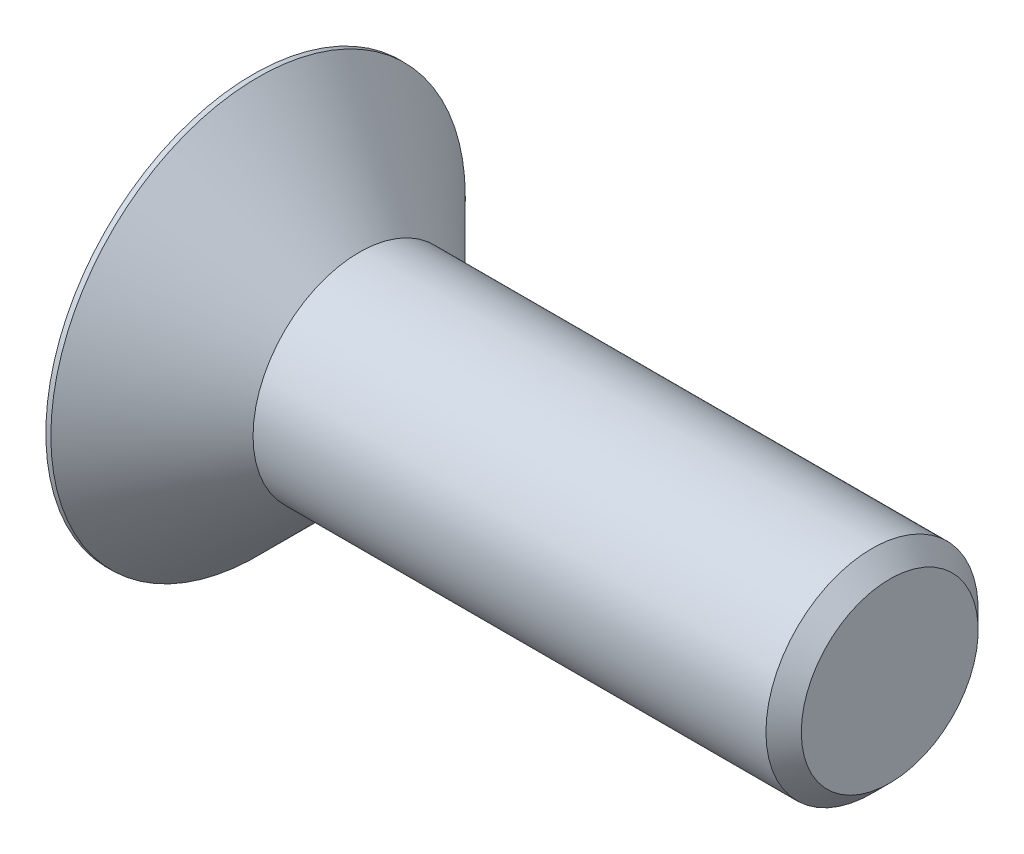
ISO-10303-21;
HEADER;
FILE_DESCRIPTION(('STEP AP214'),'2;1');
FILE_NAME('part.step','',(''),(''),'','','');
FILE_SCHEMA(('AUTOMOTIVE_DESIGN { 1 0 10303 214 1 1 1 1 }'));
ENDSEC;
DATA;
#1=APPLICATION_CONTEXT('core data for automotive mechanical design processes');
#2=APPLICATION_PROTOCOL_DEFINITION('international standard','automotive_design',2000,#1);
#3=PRODUCT_CONTEXT('',#1,'mechanical');
#4=PRODUCT('Part','Part','',(#3));
#5=PRODUCT_RELATED_PRODUCT_CATEGORY('part','',(#4));
#6=PRODUCT_DEFINITION_FORMATION('','',#4);
#7=PRODUCT_DEFINITION_CONTEXT('part definition',#1,'design');
#8=PRODUCT_DEFINITION('design','',#6,#7);
#9=PRODUCT_DEFINITION_SHAPE('','',#8);
#10=(LENGTH_UNIT() NAMED_UNIT(*) SI_UNIT(.MILLI.,.METRE.));
#11=(NAMED_UNIT(*) PLANE_ANGLE_UNIT() SI_UNIT($,.RADIAN.));
#12=(NAMED_UNIT(*) SI_UNIT($,.STERADIAN.) SOLID_ANGLE_UNIT());
#13=UNCERTAINTY_MEASURE_WITH_UNIT(LENGTH_MEASURE(1.E-05),#10,'distance_accuracy_value','');
#14=(GEOMETRIC_REPRESENTATION_CONTEXT(3) GLOBAL_UNCERTAINTY_ASSIGNED_CONTEXT((#13)) GLOBAL_UNIT_ASSIGNED_CONTEXT((#10,
#11,#12)) REPRESENTATION_CONTEXT('',''));
#15=CARTESIAN_POINT('',(0.,0.,0.));
#16=DIRECTION('',(0.,0.,1.));
#17=DIRECTION('',(1.,0.,0.));
#18=AXIS2_PLACEMENT_3D('',#15,#16,#17);
#19=CARTESIAN_POINT('',(0.,0.,0.));
#20=DIRECTION('',(1.,0.,0.));
#21=DIRECTION('',(0.,0.,-1.));
#22=AXIS2_PLACEMENT_3D('',#19,#20,#21);
#23=PLANE('',#22);
#24=CARTESIAN_POINT('',(0.,0.,0.));
#25=DIRECTION('',(1.,0.,0.));
#26=DIRECTION('',(0.,0.,-1.));
#27=AXIS2_PLACEMENT_3D('',#24,#25,#26);
#28=CIRCLE('',#27,5.85857864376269);
#29=CARTESIAN_POINT('',(0.,0.,-5.85857864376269));
#30=VERTEX_POINT('',#29);
#31=EDGE_CURVE('E42',#30,#30,#28,.F.);
#32=ORIENTED_EDGE('',*,*,#31,.T.);
#33=EDGE_LOOP('',(#32));
#34=FACE_BOUND('',#33,.T.);
#35=DIRECTION('',(0.,0.407964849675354,-0.912997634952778));
#36=VECTOR('',#35,1.);
#37=CARTESIAN_POINT('',(0.,1.44737321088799,1.99778274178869));
#38=LINE('',#37,#36);
#39=CARTESIAN_POINT('',(0.,1.44737321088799,1.99778274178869));
#40=VERTEX_POINT('',#39);
#41=CARTESIAN_POINT('',(0.,2.45381721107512,-0.254570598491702));
#42=VERTEX_POINT('',#41);
#43=EDGE_CURVE('E123',#40,#42,#38,.T.);
#44=ORIENTED_EDGE('',*,*,#43,.F.);
#45=DIRECTION('',(0.,0.994661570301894,-0.103190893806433));
#46=VECTOR('',#45,1.);
#47=CARTESIAN_POINT('',(0.,-1.00644400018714,2.25235334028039));
#48=LINE('',#47,#46);
#49=CARTESIAN_POINT('',(0.,-1.00644400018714,2.25235334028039));
#50=VERTEX_POINT('',#49);
#51=EDGE_CURVE('E49',#50,#40,#48,.T.);
#52=ORIENTED_EDGE('',*,*,#51,.F.);
#53=DIRECTION('',(0.,0.58669672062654,0.809806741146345));
#54=VECTOR('',#53,1.);
#55=CARTESIAN_POINT('',(0.,-2.45381721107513,0.254570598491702));
#56=LINE('',#55,#54);
#57=CARTESIAN_POINT('',(0.,-2.45381721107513,0.254570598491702));
#58=VERTEX_POINT('',#57);
#59=EDGE_CURVE('E132',#58,#50,#56,.T.);
#60=ORIENTED_EDGE('',*,*,#59,.F.);
#61=DIRECTION('',(0.,-0.407964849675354,0.912997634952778));
#62=VECTOR('',#61,1.);
#63=CARTESIAN_POINT('',(0.,-1.44737321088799,-1.99778274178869));
#64=LINE('',#63,#62);
#65=CARTESIAN_POINT('',(0.,-1.44737321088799,-1.99778274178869));
#66=VERTEX_POINT('',#65);
#67=EDGE_CURVE('E130',#66,#58,#64,.T.);
#68=ORIENTED_EDGE('',*,*,#67,.F.);
#69=DIRECTION('',(0.,-0.994661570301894,0.103190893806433));
#70=VECTOR('',#69,1.);
#71=CARTESIAN_POINT('',(0.,1.00644400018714,-2.25235334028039));
#72=LINE('',#71,#70);
#73=CARTESIAN_POINT('',(0.,1.00644400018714,-2.25235334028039));
#74=VERTEX_POINT('',#73);
#75=EDGE_CURVE('E97',#74,#66,#72,.T.);
#76=ORIENTED_EDGE('',*,*,#75,.F.);
#77=DIRECTION('',(0.,-0.58669672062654,-0.809806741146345));
#78=VECTOR('',#77,1.);
#79=CARTESIAN_POINT('',(0.,2.45381721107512,-0.254570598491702));
#80=LINE('',#79,#78);
#81=EDGE_CURVE('E126',#42,#74,#80,.T.);
#82=ORIENTED_EDGE('',*,*,#81,.F.);
#83=EDGE_LOOP('',(#44,#52,#60,#68,#76,#82));
#84=FACE_BOUND('',#83,.T.);
#85=ADVANCED_FACE('F34',(#34,#84),#23,.F.);
#86=CARTESIAN_POINT('',(2.99999999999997,0.,0.));
#87=DIRECTION('',(-1.,0.,0.));
#88=DIRECTION('',(0.,0.,1.));
#89=AXIS2_PLACEMENT_3D('',#86,#87,#88);
#90=CONICAL_SURFACE('',#89,3.,0.785398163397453);
#91=CARTESIAN_POINT('',(0.141421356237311,0.,0.));
#92=DIRECTION('',(1.,0.,0.));
#93=DIRECTION('',(0.,0.,-1.));
#94=AXIS2_PLACEMENT_3D('',#91,#92,#93);
#95=CIRCLE('',#94,5.85857864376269);
#96=CARTESIAN_POINT('',(0.141421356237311,0.,-5.85857864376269));
#97=VERTEX_POINT('',#96);
#98=EDGE_CURVE('E11',#97,#97,#95,.T.);
#99=ORIENTED_EDGE('',*,*,#98,.T.);
#100=EDGE_LOOP('',(#99));
#101=FACE_BOUND('',#100,.T.);
#102=CARTESIAN_POINT('',(2.99999999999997,0.,0.));
#103=DIRECTION('',(-1.,0.,0.));
#104=DIRECTION('',(0.,0.,1.));
#105=AXIS2_PLACEMENT_3D('',#102,#103,#104);
#106=CIRCLE('',#105,3.);
#107=CARTESIAN_POINT('',(2.99999999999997,0.,3.));
#108=VERTEX_POINT('',#107);
#109=EDGE_CURVE('E136',#108,#108,#106,.T.);
#110=ORIENTED_EDGE('',*,*,#109,.T.);
#111=EDGE_LOOP('',(#110));
#112=FACE_BOUND('',#111,.T.);
#113=ADVANCED_FACE('F163',(#101,#112),#90,.T.);
#114=CARTESIAN_POINT('',(0.,0.,0.));
#115=DIRECTION('',(-1.,0.,0.));
#116=DIRECTION('',(0.,0.,1.));
#117=AXIS2_PLACEMENT_3D('',#114,#115,#116);
#118=CYLINDRICAL_SURFACE('',#117,3.);
#119=CARTESIAN_POINT('',(17.5,0.,0.));
#120=DIRECTION('',(-1.,0.,0.));
#121=DIRECTION('',(0.,0.,1.));
#122=AXIS2_PLACEMENT_3D('',#119,#120,#121);
#123=CIRCLE('',#122,3.);
#124=CARTESIAN_POINT('',(17.5,0.,3.));
#125=VERTEX_POINT('',#124);
#126=EDGE_CURVE('E144',#125,#125,#123,.T.);
#127=ORIENTED_EDGE('',*,*,#126,.T.);
#128=EDGE_LOOP('',(#127));
#129=FACE_BOUND('',#128,.T.);
#130=ORIENTED_EDGE('',*,*,#109,.F.);
#131=EDGE_LOOP('',(#130));
#132=FACE_BOUND('',#131,.T.);
#133=ADVANCED_FACE('F168',(#129,#132),#118,.T.);
#134=CARTESIAN_POINT('',(18.,3.,0.));
#135=DIRECTION('',(-1.,0.,0.));
#136=DIRECTION('',(0.,0.,1.));
#137=AXIS2_PLACEMENT_3D('',#134,#135,#136);
#138=PLANE('',#137);
#139=CARTESIAN_POINT('',(18.,0.,0.));
#140=DIRECTION('',(-1.,0.,0.));
#141=DIRECTION('',(0.,0.,1.));
#142=AXIS2_PLACEMENT_3D('',#139,#140,#141);
#143=CIRCLE('',#142,2.5);
#144=CARTESIAN_POINT('',(18.,0.,2.5));
#145=VERTEX_POINT('',#144);
#146=EDGE_CURVE('E147',#145,#145,#143,.F.);
#147=ORIENTED_EDGE('',*,*,#146,.T.);
#148=EDGE_LOOP('',(#147));
#149=FACE_BOUND('',#148,.T.);
#150=ADVANCED_FACE('F175',(#149),#138,.F.);
#151=CARTESIAN_POINT('',(17.5,0.,0.));
#152=DIRECTION('',(-1.,0.,0.));
#153=DIRECTION('',(0.,0.,1.));
#154=AXIS2_PLACEMENT_3D('',#151,#152,#153);
#155=CONICAL_SURFACE('',#154,3.,0.785398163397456);
#156=ORIENTED_EDGE('',*,*,#146,.F.);
#157=EDGE_LOOP('',(#156));
#158=FACE_BOUND('',#157,.T.);
#159=ORIENTED_EDGE('',*,*,#126,.F.);
#160=EDGE_LOOP('',(#159));
#161=FACE_BOUND('',#160,.T.);
#162=ADVANCED_FACE('F172',(#158,#161),#155,.T.);
#163=CARTESIAN_POINT('',(2.5,-1.00644400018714,2.25235334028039));
#164=DIRECTION('',(0.,0.103190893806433,0.994661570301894));
#165=DIRECTION('',(0.,-0.994661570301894,0.103190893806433));
#166=AXIS2_PLACEMENT_3D('',#163,#164,#165);
#167=PLANE('',#166);
#168=ORIENTED_EDGE('',*,*,#51,.T.);
#169=DIRECTION('',(-1.,0.,0.));
#170=VECTOR('',#169,1.);
#171=CARTESIAN_POINT('',(2.5,1.44737321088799,1.99778274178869));
#172=LINE('',#171,#170);
#173=CARTESIAN_POINT('',(2.5,1.44737321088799,1.99778274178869));
#174=VERTEX_POINT('',#173);
#175=EDGE_CURVE('E79',#174,#40,#172,.T.);
#176=ORIENTED_EDGE('',*,*,#175,.F.);
#177=DIRECTION('',(0.,0.994661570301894,-0.103190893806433));
#178=VECTOR('',#177,1.);
#179=CARTESIAN_POINT('',(2.5,-1.00644400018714,2.25235334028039));
#180=LINE('',#179,#178);
#181=CARTESIAN_POINT('',(2.5,-1.00644400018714,2.25235334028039));
#182=VERTEX_POINT('',#181);
#183=EDGE_CURVE('E134',#182,#174,#180,.T.);
#184=ORIENTED_EDGE('',*,*,#183,.F.);
#185=DIRECTION('',(-1.,0.,0.));
#186=VECTOR('',#185,1.);
#187=CARTESIAN_POINT('',(2.5,-1.00644400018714,2.25235334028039));
#188=LINE('',#187,#186);
#189=EDGE_CURVE('E57',#182,#50,#188,.T.);
#190=ORIENTED_EDGE('',*,*,#189,.T.);
#191=EDGE_LOOP('',(#168,#176,#184,#190));
#192=FACE_BOUND('',#191,.T.);
#193=ADVANCED_FACE('F174',(#192),#167,.F.);
#194=CARTESIAN_POINT('',(2.5,-2.45381721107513,0.254570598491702));
#195=DIRECTION('',(0.,-0.809806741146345,0.58669672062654));
#196=DIRECTION('',(0.,-0.58669672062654,-0.809806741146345));
#197=AXIS2_PLACEMENT_3D('',#194,#195,#196);
#198=PLANE('',#197);
#199=ORIENTED_EDGE('',*,*,#59,.T.);
#200=ORIENTED_EDGE('',*,*,#189,.F.);
#201=DIRECTION('',(0.,0.58669672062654,0.809806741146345));
#202=VECTOR('',#201,1.);
#203=CARTESIAN_POINT('',(2.5,-2.45381721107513,0.254570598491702));
#204=LINE('',#203,#202);
#205=CARTESIAN_POINT('',(2.5,-2.45381721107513,0.254570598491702));
#206=VERTEX_POINT('',#205);
#207=EDGE_CURVE('E109',#206,#182,#204,.T.);
#208=ORIENTED_EDGE('',*,*,#207,.F.);
#209=DIRECTION('',(-1.,0.,0.));
#210=VECTOR('',#209,1.);
#211=CARTESIAN_POINT('',(2.5,-2.45381721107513,0.254570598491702));
#212=LINE('',#211,#210);
#213=EDGE_CURVE('E101',#206,#58,#212,.T.);
#214=ORIENTED_EDGE('',*,*,#213,.T.);
#215=EDGE_LOOP('',(#199,#200,#208,#214));
#216=FACE_BOUND('',#215,.T.);
#217=ADVANCED_FACE('F181',(#216),#198,.F.);
#218=CARTESIAN_POINT('',(2.5,-1.44737321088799,-1.99778274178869));
#219=DIRECTION('',(0.,-0.912997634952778,-0.407964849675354));
#220=DIRECTION('',(0.,0.407964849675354,-0.912997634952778));
#221=AXIS2_PLACEMENT_3D('',#218,#219,#220);
#222=PLANE('',#221);
#223=ORIENTED_EDGE('',*,*,#67,.T.);
#224=ORIENTED_EDGE('',*,*,#213,.F.);
#225=DIRECTION('',(0.,-0.407964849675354,0.912997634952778));
#226=VECTOR('',#225,1.);
#227=CARTESIAN_POINT('',(2.5,-1.44737321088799,-1.99778274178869));
#228=LINE('',#227,#226);
#229=CARTESIAN_POINT('',(2.5,-1.44737321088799,-1.99778274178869));
#230=VERTEX_POINT('',#229);
#231=EDGE_CURVE('E105',#230,#206,#228,.T.);
#232=ORIENTED_EDGE('',*,*,#231,.F.);
#233=DIRECTION('',(-1.,0.,0.));
#234=VECTOR('',#233,1.);
#235=CARTESIAN_POINT('',(2.5,-1.44737321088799,-1.99778274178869));
#236=LINE('',#235,#234);
#237=EDGE_CURVE('E90',#230,#66,#236,.T.);
#238=ORIENTED_EDGE('',*,*,#237,.T.);
#239=EDGE_LOOP('',(#223,#224,#232,#238));
#240=FACE_BOUND('',#239,.T.);
#241=ADVANCED_FACE('F106',(#240),#222,.F.);
#242=CARTESIAN_POINT('',(2.5,1.00644400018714,-2.25235334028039));
#243=DIRECTION('',(0.,-0.103190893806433,-0.994661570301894));
#244=DIRECTION('',(0.,0.994661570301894,-0.103190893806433));
#245=AXIS2_PLACEMENT_3D('',#242,#243,#244);
#246=PLANE('',#245);
#247=ORIENTED_EDGE('',*,*,#75,.T.);
#248=ORIENTED_EDGE('',*,*,#237,.F.);
#249=DIRECTION('',(0.,-0.994661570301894,0.103190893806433));
#250=VECTOR('',#249,1.);
#251=CARTESIAN_POINT('',(2.5,1.00644400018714,-2.25235334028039));
#252=LINE('',#251,#250);
#253=CARTESIAN_POINT('',(2.5,1.00644400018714,-2.25235334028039));
#254=VERTEX_POINT('',#253);
#255=EDGE_CURVE('E94',#254,#230,#252,.T.);
#256=ORIENTED_EDGE('',*,*,#255,.F.);
#257=DIRECTION('',(-1.,0.,0.));
#258=VECTOR('',#257,1.);
#259=CARTESIAN_POINT('',(2.5,1.00644400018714,-2.25235334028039));
#260=LINE('',#259,#258);
#261=EDGE_CURVE('E102',#254,#74,#260,.T.);
#262=ORIENTED_EDGE('',*,*,#261,.T.);
#263=EDGE_LOOP('',(#247,#248,#256,#262));
#264=FACE_BOUND('',#263,.T.);
#265=ADVANCED_FACE('F92',(#264),#246,.F.);
#266=CARTESIAN_POINT('',(2.5,2.45381721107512,-0.254570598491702));
#267=DIRECTION('',(0.,0.809806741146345,-0.58669672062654));
#268=DIRECTION('',(0.,0.58669672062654,0.809806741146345));
#269=AXIS2_PLACEMENT_3D('',#266,#267,#268);
#270=PLANE('',#269);
#271=ORIENTED_EDGE('',*,*,#81,.T.);
#272=ORIENTED_EDGE('',*,*,#261,.F.);
#273=DIRECTION('',(0.,-0.58669672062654,-0.809806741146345));
#274=VECTOR('',#273,1.);
#275=CARTESIAN_POINT('',(2.5,2.45381721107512,-0.254570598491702));
#276=LINE('',#275,#274);
#277=CARTESIAN_POINT('',(2.5,2.45381721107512,-0.254570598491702));
#278=VERTEX_POINT('',#277);
#279=EDGE_CURVE('E115',#278,#254,#276,.T.);
#280=ORIENTED_EDGE('',*,*,#279,.F.);
#281=DIRECTION('',(-1.,0.,0.));
#282=VECTOR('',#281,1.);
#283=CARTESIAN_POINT('',(2.5,2.45381721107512,-0.254570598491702));
#284=LINE('',#283,#282);
#285=EDGE_CURVE('E139',#278,#42,#284,.T.);
#286=ORIENTED_EDGE('',*,*,#285,.T.);
#287=EDGE_LOOP('',(#271,#272,#280,#286));
#288=FACE_BOUND('',#287,.T.);
#289=ADVANCED_FACE('F198',(#288),#270,.F.);
#290=CARTESIAN_POINT('',(2.5,1.44737321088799,1.99778274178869));
#291=DIRECTION('',(0.,0.912997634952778,0.407964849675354));
#292=DIRECTION('',(0.,-0.407964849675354,0.912997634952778));
#293=AXIS2_PLACEMENT_3D('',#290,#291,#292);
#294=PLANE('',#293);
#295=ORIENTED_EDGE('',*,*,#43,.T.);
#296=ORIENTED_EDGE('',*,*,#285,.F.);
#297=DIRECTION('',(0.,0.407964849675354,-0.912997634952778));
#298=VECTOR('',#297,1.);
#299=CARTESIAN_POINT('',(2.5,1.44737321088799,1.99778274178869));
#300=LINE('',#299,#298);
#301=EDGE_CURVE('E117',#174,#278,#300,.T.);
#302=ORIENTED_EDGE('',*,*,#301,.F.);
#303=ORIENTED_EDGE('',*,*,#175,.T.);
#304=EDGE_LOOP('',(#295,#296,#302,#303));
#305=FACE_BOUND('',#304,.T.);
#306=ADVANCED_FACE('F159',(#305),#294,.F.);
#307=CARTESIAN_POINT('',(2.5,0.,0.));
#308=DIRECTION('',(-1.,0.,0.));
#309=DIRECTION('',(0.,0.,1.));
#310=AXIS2_PLACEMENT_3D('',#307,#308,#309);
#311=PLANE('',#310);
#312=ORIENTED_EDGE('',*,*,#183,.T.);
#313=ORIENTED_EDGE('',*,*,#301,.T.);
#314=ORIENTED_EDGE('',*,*,#279,.T.);
#315=ORIENTED_EDGE('',*,*,#255,.T.);
#316=ORIENTED_EDGE('',*,*,#231,.T.);
#317=ORIENTED_EDGE('',*,*,#207,.T.);
#318=EDGE_LOOP('',(#312,#313,#314,#315,#316,#317));
#319=FACE_BOUND('',#318,.T.);
#320=ADVANCED_FACE('F112',(#319),#311,.T.);
#321=CARTESIAN_POINT('',(0.,0.,0.));
#322=DIRECTION('',(1.,0.,0.));
#323=DIRECTION('',(0.,0.,-1.));
#324=AXIS2_PLACEMENT_3D('',#321,#322,#323);
#325=CYLINDRICAL_SURFACE('',#324,5.85857864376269);
#326=ORIENTED_EDGE('',*,*,#98,.F.);
#327=EDGE_LOOP('',(#326));
#328=FACE_BOUND('',#327,.T.);
#329=ORIENTED_EDGE('',*,*,#31,.F.);
#330=EDGE_LOOP('',(#329));
#331=FACE_BOUND('',#330,.T.);
#332=ADVANCED_FACE('F36',(#328,#331),#325,.T.);
#333=CLOSED_SHELL('',(#85,#113,#133,#150,#162,#193,#217,#241,#265,#289,#306,#320,#332));
#334=MANIFOLD_SOLID_BREP('B2',#333);
#335=ADVANCED_BREP_SHAPE_REPRESENTATION('',(#18,#334),#14);
#336=SHAPE_DEFINITION_REPRESENTATION(#9,#335);
ENDSEC;
END-ISO-10303-21;
